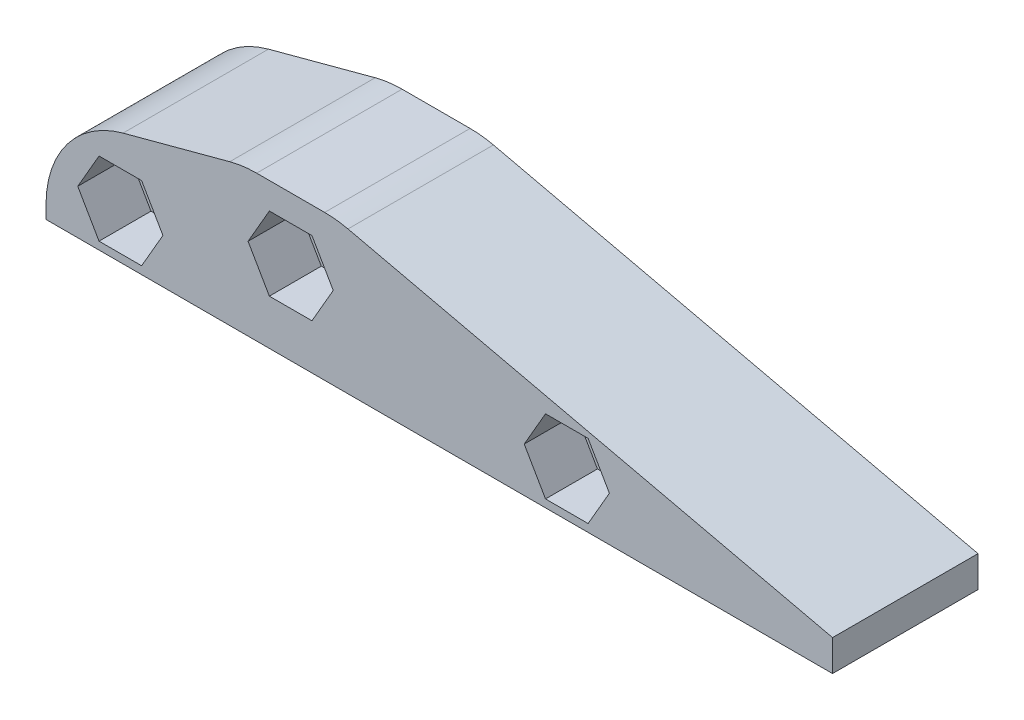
ISO-10303-21;
HEADER;
FILE_DESCRIPTION(('STEP AP214'),'2;1');
FILE_NAME('part.step','',(''),(''),'','','');
FILE_SCHEMA(('AUTOMOTIVE_DESIGN { 1 0 10303 214 1 1 1 1 }'));
ENDSEC;
DATA;
#1=APPLICATION_CONTEXT('core data for automotive mechanical design processes');
#2=APPLICATION_PROTOCOL_DEFINITION('international standard','automotive_design',2000,#1);
#3=PRODUCT_CONTEXT('',#1,'mechanical');
#4=PRODUCT('Part','Part','',(#3));
#5=PRODUCT_RELATED_PRODUCT_CATEGORY('part','',(#4));
#6=PRODUCT_DEFINITION_FORMATION('','',#4);
#7=PRODUCT_DEFINITION_CONTEXT('part definition',#1,'design');
#8=PRODUCT_DEFINITION('design','',#6,#7);
#9=PRODUCT_DEFINITION_SHAPE('','',#8);
#10=(LENGTH_UNIT() NAMED_UNIT(*) SI_UNIT(.MILLI.,.METRE.));
#11=(NAMED_UNIT(*) PLANE_ANGLE_UNIT() SI_UNIT($,.RADIAN.));
#12=(NAMED_UNIT(*) SI_UNIT($,.STERADIAN.) SOLID_ANGLE_UNIT());
#13=UNCERTAINTY_MEASURE_WITH_UNIT(LENGTH_MEASURE(1.E-05),#10,'distance_accuracy_value','');
#14=(GEOMETRIC_REPRESENTATION_CONTEXT(3) GLOBAL_UNCERTAINTY_ASSIGNED_CONTEXT((#13)) GLOBAL_UNIT_ASSIGNED_CONTEXT((#10,
#11,#12)) REPRESENTATION_CONTEXT('',''));
#15=CARTESIAN_POINT('',(0.,0.,0.));
#16=DIRECTION('',(0.,0.,1.));
#17=DIRECTION('',(1.,0.,0.));
#18=AXIS2_PLACEMENT_3D('',#15,#16,#17);
#19=CARTESIAN_POINT('',(75.7081636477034,0.,14.));
#20=DIRECTION('',(0.,1.,0.));
#21=DIRECTION('',(-1.,0.,0.));
#22=AXIS2_PLACEMENT_3D('',#19,#20,#21);
#23=PLANE('',#22);
#24=DIRECTION('',(1.,0.,0.));
#25=VECTOR('',#24,1.);
#26=CARTESIAN_POINT('',(75.7081636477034,0.,0.));
#27=LINE('',#26,#25);
#28=CARTESIAN_POINT('',(0.,0.,0.));
#29=VERTEX_POINT('',#28);
#30=CARTESIAN_POINT('',(75.7081636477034,0.,0.));
#31=VERTEX_POINT('',#30);
#32=EDGE_CURVE('E406',#29,#31,#27,.T.);
#33=ORIENTED_EDGE('',*,*,#32,.T.);
#34=DIRECTION('',(0.,0.,-1.));
#35=VECTOR('',#34,1.);
#36=CARTESIAN_POINT('',(75.7081636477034,0.,14.));
#37=LINE('',#36,#35);
#38=CARTESIAN_POINT('',(75.7081636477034,0.,14.));
#39=VERTEX_POINT('',#38);
#40=EDGE_CURVE('E471',#39,#31,#37,.T.);
#41=ORIENTED_EDGE('',*,*,#40,.F.);
#42=DIRECTION('',(1.,0.,0.));
#43=VECTOR('',#42,1.);
#44=CARTESIAN_POINT('',(75.7081636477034,0.,14.));
#45=LINE('',#44,#43);
#46=CARTESIAN_POINT('',(0.,0.,14.));
#47=VERTEX_POINT('',#46);
#48=EDGE_CURVE('E422',#47,#39,#45,.T.);
#49=ORIENTED_EDGE('',*,*,#48,.F.);
#50=DIRECTION('',(0.,0.,-1.));
#51=VECTOR('',#50,1.);
#52=CARTESIAN_POINT('',(0.,0.,14.));
#53=LINE('',#52,#51);
#54=EDGE_CURVE('E444',#47,#29,#53,.T.);
#55=ORIENTED_EDGE('',*,*,#54,.T.);
#56=EDGE_LOOP('',(#33,#41,#49,#55));
#57=FACE_BOUND('',#56,.T.);
#58=ADVANCED_FACE('F35',(#57),#23,.F.);
#59=CARTESIAN_POINT('',(75.7081636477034,3.,14.));
#60=DIRECTION('',(-1.,0.,0.));
#61=DIRECTION('',(0.,0.,1.));
#62=AXIS2_PLACEMENT_3D('',#59,#60,#61);
#63=PLANE('',#62);
#64=DIRECTION('',(0.,1.,0.));
#65=VECTOR('',#64,1.);
#66=CARTESIAN_POINT('',(75.7081636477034,3.,0.));
#67=LINE('',#66,#65);
#68=CARTESIAN_POINT('',(75.7081636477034,3.,0.));
#69=VERTEX_POINT('',#68);
#70=EDGE_CURVE('E448',#31,#69,#67,.T.);
#71=ORIENTED_EDGE('',*,*,#70,.T.);
#72=DIRECTION('',(0.,0.,-1.));
#73=VECTOR('',#72,1.);
#74=CARTESIAN_POINT('',(75.7081636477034,3.,14.));
#75=LINE('',#74,#73);
#76=CARTESIAN_POINT('',(75.7081636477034,3.,14.));
#77=VERTEX_POINT('',#76);
#78=EDGE_CURVE('E467',#77,#69,#75,.T.);
#79=ORIENTED_EDGE('',*,*,#78,.F.);
#80=DIRECTION('',(0.,1.,0.));
#81=VECTOR('',#80,1.);
#82=CARTESIAN_POINT('',(75.7081636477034,3.,14.));
#83=LINE('',#82,#81);
#84=EDGE_CURVE('E426',#39,#77,#83,.T.);
#85=ORIENTED_EDGE('',*,*,#84,.F.);
#86=ORIENTED_EDGE('',*,*,#40,.T.);
#87=EDGE_LOOP('',(#71,#79,#85,#86));
#88=FACE_BOUND('',#87,.T.);
#89=ADVANCED_FACE('F530',(#88),#63,.F.);
#90=CARTESIAN_POINT('',(27.9588181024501,14.,14.));
#91=DIRECTION('',(-0.224489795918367,-0.974476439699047,0.));
#92=DIRECTION('',(0.974476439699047,-0.224489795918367,0.));
#93=AXIS2_PLACEMENT_3D('',#90,#91,#92);
#94=PLANE('',#93);
#95=DIRECTION('',(-0.974476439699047,0.224489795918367,0.));
#96=VECTOR('',#95,1.);
#97=CARTESIAN_POINT('',(27.9588181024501,14.,0.));
#98=LINE('',#97,#96);
#99=CARTESIAN_POINT('',(29.0667574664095,13.7447643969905,0.));
#100=VERTEX_POINT('',#99);
#101=EDGE_CURVE('E451',#69,#100,#98,.T.);
#102=ORIENTED_EDGE('',*,*,#101,.T.);
#103=DIRECTION('',(0.,0.,-1.));
#104=VECTOR('',#103,1.);
#105=CARTESIAN_POINT('',(29.0667574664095,13.7447643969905,14.));
#106=LINE('',#105,#104);
#107=CARTESIAN_POINT('',(29.0667574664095,13.7447643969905,14.));
#108=VERTEX_POINT('',#107);
#109=EDGE_CURVE('E503',#100,#108,#106,.F.);
#110=ORIENTED_EDGE('',*,*,#109,.T.);
#111=DIRECTION('',(-0.974476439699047,0.224489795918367,0.));
#112=VECTOR('',#111,1.);
#113=CARTESIAN_POINT('',(27.9588181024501,14.,14.));
#114=LINE('',#113,#112);
#115=EDGE_CURVE('E430',#77,#108,#114,.T.);
#116=ORIENTED_EDGE('',*,*,#115,.F.);
#117=ORIENTED_EDGE('',*,*,#78,.T.);
#118=EDGE_LOOP('',(#102,#110,#116,#117));
#119=FACE_BOUND('',#118,.T.);
#120=ADVANCED_FACE('F527',(#119),#94,.F.);
#121=CARTESIAN_POINT('',(18.9588181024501,14.,14.));
#122=DIRECTION('',(0.,-1.,0.));
#123=DIRECTION('',(0.,0.,-1.));
#124=AXIS2_PLACEMENT_3D('',#121,#122,#123);
#125=PLANE('',#124);
#126=DIRECTION('',(-1.,0.,0.));
#127=VECTOR('',#126,1.);
#128=CARTESIAN_POINT('',(18.9588181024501,14.,14.));
#129=LINE('',#128,#127);
#130=CARTESIAN_POINT('',(26.8218595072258,14.,14.));
#131=VERTEX_POINT('',#130);
#132=CARTESIAN_POINT('',(20.275343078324,14.,14.));
#133=VERTEX_POINT('',#132);
#134=EDGE_CURVE('E434',#131,#133,#129,.T.);
#135=ORIENTED_EDGE('',*,*,#134,.F.);
#136=DIRECTION('',(0.,0.,-1.));
#137=VECTOR('',#136,1.);
#138=CARTESIAN_POINT('',(26.8218595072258,14.,14.));
#139=LINE('',#138,#137);
#140=CARTESIAN_POINT('',(26.8218595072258,14.,0.));
#141=VERTEX_POINT('',#140);
#142=EDGE_CURVE('E493',#131,#141,#139,.T.);
#143=ORIENTED_EDGE('',*,*,#142,.T.);
#144=DIRECTION('',(-1.,0.,0.));
#145=VECTOR('',#144,1.);
#146=CARTESIAN_POINT('',(18.9588181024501,14.,0.));
#147=LINE('',#146,#145);
#148=CARTESIAN_POINT('',(20.275343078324,14.,0.));
#149=VERTEX_POINT('',#148);
#150=EDGE_CURVE('E455',#141,#149,#147,.T.);
#151=ORIENTED_EDGE('',*,*,#150,.T.);
#152=DIRECTION('',(0.,0.,-1.));
#153=VECTOR('',#152,1.);
#154=CARTESIAN_POINT('',(20.275343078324,14.,14.));
#155=LINE('',#154,#153);
#156=EDGE_CURVE('E490',#149,#133,#155,.F.);
#157=ORIENTED_EDGE('',*,*,#156,.T.);
#158=EDGE_LOOP('',(#135,#143,#151,#157));
#159=FACE_BOUND('',#158,.T.);
#160=ADVANCED_FACE('F519',(#159),#125,.F.);
#161=CARTESIAN_POINT('',(0.,8.92,14.));
#162=DIRECTION('',(0.258819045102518,-0.965925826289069,0.));
#163=DIRECTION('',(0.965925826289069,0.258819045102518,0.));
#164=AXIS2_PLACEMENT_3D('',#161,#162,#163);
#165=PLANE('',#164);
#166=DIRECTION('',(-0.965925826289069,-0.258819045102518,0.));
#167=VECTOR('',#166,1.);
#168=CARTESIAN_POINT('',(0.,8.92,14.));
#169=LINE('',#168,#167);
#170=CARTESIAN_POINT('',(17.6871526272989,13.6592582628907,14.));
#171=VERTEX_POINT('',#170);
#172=CARTESIAN_POINT('',(7.41180954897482,10.9059883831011,14.));
#173=VERTEX_POINT('',#172);
#174=EDGE_CURVE('E438',#171,#173,#169,.T.);
#175=ORIENTED_EDGE('',*,*,#174,.F.);
#176=DIRECTION('',(0.,0.,-1.));
#177=VECTOR('',#176,1.);
#178=CARTESIAN_POINT('',(17.6871526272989,13.6592582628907,14.));
#179=LINE('',#178,#177);
#180=CARTESIAN_POINT('',(17.6871526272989,13.6592582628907,0.));
#181=VERTEX_POINT('',#180);
#182=EDGE_CURVE('E11',#171,#181,#179,.T.);
#183=ORIENTED_EDGE('',*,*,#182,.T.);
#184=DIRECTION('',(-0.965925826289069,-0.258819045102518,0.));
#185=VECTOR('',#184,1.);
#186=CARTESIAN_POINT('',(0.,8.92,0.));
#187=LINE('',#186,#185);
#188=CARTESIAN_POINT('',(7.41180954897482,10.9059883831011,0.));
#189=VERTEX_POINT('',#188);
#190=EDGE_CURVE('E459',#181,#189,#187,.T.);
#191=ORIENTED_EDGE('',*,*,#190,.T.);
#192=DIRECTION('',(0.,0.,-1.));
#193=VECTOR('',#192,1.);
#194=CARTESIAN_POINT('',(7.41180954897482,10.9059883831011,14.));
#195=LINE('',#194,#193);
#196=EDGE_CURVE('E483',#189,#173,#195,.F.);
#197=ORIENTED_EDGE('',*,*,#196,.T.);
#198=EDGE_LOOP('',(#175,#183,#191,#197));
#199=FACE_BOUND('',#198,.T.);
#200=ADVANCED_FACE('F548',(#199),#165,.F.);
#201=CARTESIAN_POINT('',(0.,0.,14.));
#202=DIRECTION('',(1.,0.,0.));
#203=DIRECTION('',(0.,0.,-1.));
#204=AXIS2_PLACEMENT_3D('',#201,#202,#203);
#205=PLANE('',#204);
#206=DIRECTION('',(0.,-1.,0.));
#207=VECTOR('',#206,1.);
#208=CARTESIAN_POINT('',(0.,0.,14.));
#209=LINE('',#208,#207);
#210=CARTESIAN_POINT('',(0.,1.24673012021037,14.));
#211=VERTEX_POINT('',#210);
#212=EDGE_CURVE('E441',#211,#47,#209,.T.);
#213=ORIENTED_EDGE('',*,*,#212,.F.);
#214=DIRECTION('',(0.,0.,-1.));
#215=VECTOR('',#214,1.);
#216=CARTESIAN_POINT('',(0.,1.24673012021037,14.));
#217=LINE('',#216,#215);
#218=CARTESIAN_POINT('',(0.,1.24673012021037,0.));
#219=VERTEX_POINT('',#218);
#220=EDGE_CURVE('E475',#211,#219,#217,.T.);
#221=ORIENTED_EDGE('',*,*,#220,.T.);
#222=DIRECTION('',(0.,-1.,0.));
#223=VECTOR('',#222,1.);
#224=CARTESIAN_POINT('',(0.,0.,0.));
#225=LINE('',#224,#223);
#226=EDGE_CURVE('E427',#219,#29,#225,.T.);
#227=ORIENTED_EDGE('',*,*,#226,.T.);
#228=ORIENTED_EDGE('',*,*,#54,.F.);
#229=EDGE_LOOP('',(#213,#221,#227,#228));
#230=FACE_BOUND('',#229,.T.);
#231=ADVANCED_FACE('F539',(#230),#205,.F.);
#232=CARTESIAN_POINT('',(0.,0.,14.));
#233=DIRECTION('',(0.,0.,-1.));
#234=DIRECTION('',(-1.,0.,0.));
#235=AXIS2_PLACEMENT_3D('',#232,#233,#234);
#236=PLANE('',#235);
#237=DIRECTION('',(0.5,0.866025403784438,0.));
#238=VECTOR('',#237,1.);
#239=CARTESIAN_POINT('',(25.5981947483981,4.35688835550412,14.));
#240=LINE('',#239,#238);
#241=CARTESIAN_POINT('',(25.5981947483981,4.35688835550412,14.));
#242=VERTEX_POINT('',#241);
#243=CARTESIAN_POINT('',(27.6477882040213,7.90688835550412,14.));
#244=VERTEX_POINT('',#243);
#245=EDGE_CURVE('E262',#242,#244,#240,.T.);
#246=ORIENTED_EDGE('',*,*,#245,.F.);
#247=DIRECTION('',(1.,0.,0.));
#248=VECTOR('',#247,1.);
#249=CARTESIAN_POINT('',(21.4990078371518,4.35688835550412,14.));
#250=LINE('',#249,#248);
#251=CARTESIAN_POINT('',(21.4990078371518,4.35688835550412,14.));
#252=VERTEX_POINT('',#251);
#253=EDGE_CURVE('E51',#252,#242,#250,.T.);
#254=ORIENTED_EDGE('',*,*,#253,.F.);
#255=DIRECTION('',(0.499999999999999,-0.866025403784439,0.));
#256=VECTOR('',#255,1.);
#257=CARTESIAN_POINT('',(19.4494143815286,7.90688835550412,14.));
#258=LINE('',#257,#256);
#259=CARTESIAN_POINT('',(19.4494143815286,7.90688835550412,14.));
#260=VERTEX_POINT('',#259);
#261=EDGE_CURVE('E239',#260,#252,#258,.T.);
#262=ORIENTED_EDGE('',*,*,#261,.F.);
#263=DIRECTION('',(-0.5,-0.866025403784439,0.));
#264=VECTOR('',#263,1.);
#265=CARTESIAN_POINT('',(21.4990078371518,11.4568883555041,14.));
#266=LINE('',#265,#264);
#267=CARTESIAN_POINT('',(21.4990078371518,11.4568883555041,14.));
#268=VERTEX_POINT('',#267);
#269=EDGE_CURVE('E243',#268,#260,#266,.T.);
#270=ORIENTED_EDGE('',*,*,#269,.F.);
#271=DIRECTION('',(-1.,0.,0.));
#272=VECTOR('',#271,1.);
#273=CARTESIAN_POINT('',(25.5981947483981,11.4568883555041,14.));
#274=LINE('',#273,#272);
#275=CARTESIAN_POINT('',(25.5981947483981,11.4568883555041,14.));
#276=VERTEX_POINT('',#275);
#277=EDGE_CURVE('E270',#276,#268,#274,.T.);
#278=ORIENTED_EDGE('',*,*,#277,.F.);
#279=DIRECTION('',(-0.5,0.866025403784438,0.));
#280=VECTOR('',#279,1.);
#281=CARTESIAN_POINT('',(27.6477882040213,7.90688835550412,14.));
#282=LINE('',#281,#280);
#283=EDGE_CURVE('E266',#244,#276,#282,.T.);
#284=ORIENTED_EDGE('',*,*,#283,.F.);
#285=EDGE_LOOP('',(#246,#254,#262,#270,#278,#284));
#286=FACE_BOUND('',#285,.T.);
#287=DIRECTION('',(0.5,0.866025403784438,0.));
#288=VECTOR('',#287,1.);
#289=CARTESIAN_POINT('',(52.1792396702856,0.743591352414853,14.));
#290=LINE('',#289,#288);
#291=CARTESIAN_POINT('',(52.1792396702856,0.743591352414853,14.));
#292=VERTEX_POINT('',#291);
#293=CARTESIAN_POINT('',(54.2288331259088,4.29359135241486,14.));
#294=VERTEX_POINT('',#293);
#295=EDGE_CURVE('E320',#292,#294,#290,.T.);
#296=ORIENTED_EDGE('',*,*,#295,.F.);
#297=DIRECTION('',(1.,0.,0.));
#298=VECTOR('',#297,1.);
#299=CARTESIAN_POINT('',(48.0800527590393,0.743591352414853,14.));
#300=LINE('',#299,#298);
#301=CARTESIAN_POINT('',(48.0800527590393,0.743591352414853,14.));
#302=VERTEX_POINT('',#301);
#303=EDGE_CURVE('E59',#302,#292,#300,.T.);
#304=ORIENTED_EDGE('',*,*,#303,.F.);
#305=DIRECTION('',(0.5,-0.866025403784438,0.));
#306=VECTOR('',#305,1.);
#307=CARTESIAN_POINT('',(46.0304593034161,4.29359135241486,14.));
#308=LINE('',#307,#306);
#309=CARTESIAN_POINT('',(46.0304593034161,4.29359135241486,14.));
#310=VERTEX_POINT('',#309);
#311=EDGE_CURVE('E297',#310,#302,#308,.T.);
#312=ORIENTED_EDGE('',*,*,#311,.F.);
#313=DIRECTION('',(-0.5,-0.866025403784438,0.));
#314=VECTOR('',#313,1.);
#315=CARTESIAN_POINT('',(48.0800527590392,7.84359135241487,14.));
#316=LINE('',#315,#314);
#317=CARTESIAN_POINT('',(48.0800527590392,7.84359135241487,14.));
#318=VERTEX_POINT('',#317);
#319=EDGE_CURVE('E333',#318,#310,#316,.T.);
#320=ORIENTED_EDGE('',*,*,#319,.F.);
#321=DIRECTION('',(-1.,0.,0.));
#322=VECTOR('',#321,1.);
#323=CARTESIAN_POINT('',(52.1792396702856,7.84359135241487,14.));
#324=LINE('',#323,#322);
#325=CARTESIAN_POINT('',(52.1792396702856,7.84359135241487,14.));
#326=VERTEX_POINT('',#325);
#327=EDGE_CURVE('E329',#326,#318,#324,.T.);
#328=ORIENTED_EDGE('',*,*,#327,.F.);
#329=DIRECTION('',(-0.499999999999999,0.866025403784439,0.));
#330=VECTOR('',#329,1.);
#331=CARTESIAN_POINT('',(54.2288331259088,4.29359135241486,14.));
#332=LINE('',#331,#330);
#333=EDGE_CURVE('E325',#294,#326,#332,.T.);
#334=ORIENTED_EDGE('',*,*,#333,.F.);
#335=EDGE_LOOP('',(#296,#304,#312,#320,#328,#334));
#336=FACE_BOUND('',#335,.T.);
#337=DIRECTION('',(0.5,0.866025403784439,0.));
#338=VECTOR('',#337,1.);
#339=CARTESIAN_POINT('',(9.2045979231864,0.743591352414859,14.));
#340=LINE('',#339,#338);
#341=CARTESIAN_POINT('',(9.2045979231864,0.743591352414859,14.));
#342=VERTEX_POINT('',#341);
#343=CARTESIAN_POINT('',(11.2541913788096,4.29359135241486,14.));
#344=VERTEX_POINT('',#343);
#345=EDGE_CURVE('E384',#342,#344,#340,.T.);
#346=ORIENTED_EDGE('',*,*,#345,.F.);
#347=DIRECTION('',(1.,0.,0.));
#348=VECTOR('',#347,1.);
#349=CARTESIAN_POINT('',(5.10541101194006,0.743591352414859,14.));
#350=LINE('',#349,#348);
#351=CARTESIAN_POINT('',(5.10541101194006,0.743591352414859,14.));
#352=VERTEX_POINT('',#351);
#353=EDGE_CURVE('E280',#352,#342,#350,.T.);
#354=ORIENTED_EDGE('',*,*,#353,.F.);
#355=DIRECTION('',(0.5,-0.866025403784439,0.));
#356=VECTOR('',#355,1.);
#357=CARTESIAN_POINT('',(3.05581755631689,4.29359135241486,14.));
#358=LINE('',#357,#356);
#359=CARTESIAN_POINT('',(3.05581755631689,4.29359135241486,14.));
#360=VERTEX_POINT('',#359);
#361=EDGE_CURVE('E361',#360,#352,#358,.T.);
#362=ORIENTED_EDGE('',*,*,#361,.F.);
#363=DIRECTION('',(-0.5,-0.866025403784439,0.));
#364=VECTOR('',#363,1.);
#365=CARTESIAN_POINT('',(5.10541101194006,7.84359135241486,14.));
#366=LINE('',#365,#364);
#367=CARTESIAN_POINT('',(5.10541101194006,7.84359135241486,14.));
#368=VERTEX_POINT('',#367);
#369=EDGE_CURVE('E396',#368,#360,#366,.T.);
#370=ORIENTED_EDGE('',*,*,#369,.F.);
#371=DIRECTION('',(-1.,0.,0.));
#372=VECTOR('',#371,1.);
#373=CARTESIAN_POINT('',(9.2045979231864,7.84359135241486,14.));
#374=LINE('',#373,#372);
#375=CARTESIAN_POINT('',(9.2045979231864,7.84359135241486,14.));
#376=VERTEX_POINT('',#375);
#377=EDGE_CURVE('E392',#376,#368,#374,.T.);
#378=ORIENTED_EDGE('',*,*,#377,.F.);
#379=DIRECTION('',(-0.5,0.866025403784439,0.));
#380=VECTOR('',#379,1.);
#381=CARTESIAN_POINT('',(11.2541913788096,4.29359135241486,14.));
#382=LINE('',#381,#380);
#383=EDGE_CURVE('E388',#344,#376,#382,.T.);
#384=ORIENTED_EDGE('',*,*,#383,.F.);
#385=EDGE_LOOP('',(#346,#354,#362,#370,#378,#384));
#386=FACE_BOUND('',#385,.T.);
#387=ORIENTED_EDGE('',*,*,#115,.T.);
#388=CARTESIAN_POINT('',(26.8218595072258,3.99999999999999,14.));
#389=DIRECTION('',(0.,0.,-1.));
#390=DIRECTION('',(-1.,0.,0.));
#391=AXIS2_PLACEMENT_3D('',#388,#389,#390);
#392=CIRCLE('',#391,10.);
#393=EDGE_CURVE('E44',#108,#131,#392,.F.);
#394=ORIENTED_EDGE('',*,*,#393,.T.);
#395=ORIENTED_EDGE('',*,*,#134,.T.);
#396=CARTESIAN_POINT('',(20.275343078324,3.99999999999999,14.));
#397=DIRECTION('',(0.,0.,-1.));
#398=DIRECTION('',(-1.,0.,0.));
#399=AXIS2_PLACEMENT_3D('',#396,#397,#398);
#400=CIRCLE('',#399,10.);
#401=EDGE_CURVE('E506',#133,#171,#400,.F.);
#402=ORIENTED_EDGE('',*,*,#401,.T.);
#403=ORIENTED_EDGE('',*,*,#174,.T.);
#404=CARTESIAN_POINT('',(10.,1.24673012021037,14.));
#405=DIRECTION('',(0.,0.,-1.));
#406=DIRECTION('',(-1.,0.,0.));
#407=AXIS2_PLACEMENT_3D('',#404,#405,#406);
#408=CIRCLE('',#407,10.);
#409=EDGE_CURVE('E487',#173,#211,#408,.F.);
#410=ORIENTED_EDGE('',*,*,#409,.T.);
#411=ORIENTED_EDGE('',*,*,#212,.T.);
#412=ORIENTED_EDGE('',*,*,#48,.T.);
#413=ORIENTED_EDGE('',*,*,#84,.T.);
#414=EDGE_LOOP('',(#387,#394,#395,#402,#403,#410,#411,#412,#413));
#415=FACE_BOUND('',#414,.T.);
#416=ADVANCED_FACE('F512',(#286,#336,#386,#415),#236,.F.);
#417=CARTESIAN_POINT('',(0.,0.,0.));
#418=DIRECTION('',(0.,0.,-1.));
#419=DIRECTION('',(-1.,0.,0.));
#420=AXIS2_PLACEMENT_3D('',#417,#418,#419);
#421=PLANE('',#420);
#422=CARTESIAN_POINT('',(23.5486012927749,7.90688835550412,0.));
#423=DIRECTION('',(0.,0.,1.));
#424=DIRECTION('',(1.,0.,0.));
#425=AXIS2_PLACEMENT_3D('',#422,#423,#424);
#426=CIRCLE('',#425,2.05);
#427=CARTESIAN_POINT('',(25.5986012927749,7.90688835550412,0.));
#428=VERTEX_POINT('',#427);
#429=EDGE_CURVE('E868',#428,#428,#426,.T.);
#430=ORIENTED_EDGE('',*,*,#429,.T.);
#431=EDGE_LOOP('',(#430));
#432=FACE_BOUND('',#431,.T.);
#433=CARTESIAN_POINT('',(50.1296462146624,4.29359135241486,0.));
#434=DIRECTION('',(0.,0.,1.));
#435=DIRECTION('',(1.,0.,0.));
#436=AXIS2_PLACEMENT_3D('',#433,#434,#435);
#437=CIRCLE('',#436,2.04999999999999);
#438=CARTESIAN_POINT('',(52.1796462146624,4.29359135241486,0.));
#439=VERTEX_POINT('',#438);
#440=EDGE_CURVE('E852',#439,#439,#437,.T.);
#441=ORIENTED_EDGE('',*,*,#440,.T.);
#442=EDGE_LOOP('',(#441));
#443=FACE_BOUND('',#442,.T.);
#444=CARTESIAN_POINT('',(7.15500446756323,4.29359135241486,0.));
#445=DIRECTION('',(0.,0.,1.));
#446=DIRECTION('',(1.,0.,0.));
#447=AXIS2_PLACEMENT_3D('',#444,#445,#446);
#448=CIRCLE('',#447,2.05);
#449=CARTESIAN_POINT('',(9.20500446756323,4.29359135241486,0.));
#450=VERTEX_POINT('',#449);
#451=EDGE_CURVE('E321',#450,#450,#448,.T.);
#452=ORIENTED_EDGE('',*,*,#451,.T.);
#453=EDGE_LOOP('',(#452));
#454=FACE_BOUND('',#453,.T.);
#455=ORIENTED_EDGE('',*,*,#150,.F.);
#456=CARTESIAN_POINT('',(26.8218595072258,3.99999999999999,0.));
#457=DIRECTION('',(0.,0.,-1.));
#458=DIRECTION('',(-1.,0.,0.));
#459=AXIS2_PLACEMENT_3D('',#456,#457,#458);
#460=CIRCLE('',#459,10.);
#461=EDGE_CURVE('E500',#141,#100,#460,.T.);
#462=ORIENTED_EDGE('',*,*,#461,.T.);
#463=ORIENTED_EDGE('',*,*,#101,.F.);
#464=ORIENTED_EDGE('',*,*,#70,.F.);
#465=ORIENTED_EDGE('',*,*,#32,.F.);
#466=ORIENTED_EDGE('',*,*,#226,.F.);
#467=CARTESIAN_POINT('',(10.,1.24673012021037,0.));
#468=DIRECTION('',(0.,0.,-1.));
#469=DIRECTION('',(-1.,0.,0.));
#470=AXIS2_PLACEMENT_3D('',#467,#468,#469);
#471=CIRCLE('',#470,10.);
#472=EDGE_CURVE('E479',#219,#189,#471,.T.);
#473=ORIENTED_EDGE('',*,*,#472,.T.);
#474=ORIENTED_EDGE('',*,*,#190,.F.);
#475=CARTESIAN_POINT('',(20.275343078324,3.99999999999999,0.));
#476=DIRECTION('',(0.,0.,-1.));
#477=DIRECTION('',(-1.,0.,0.));
#478=AXIS2_PLACEMENT_3D('',#475,#476,#477);
#479=CIRCLE('',#478,10.);
#480=EDGE_CURVE('E497',#181,#149,#479,.T.);
#481=ORIENTED_EDGE('',*,*,#480,.T.);
#482=EDGE_LOOP('',(#455,#462,#463,#464,#465,#466,#473,#474,#481));
#483=FACE_BOUND('',#482,.T.);
#484=ADVANCED_FACE('F525',(#432,#443,#454,#483),#421,.T.);
#485=CARTESIAN_POINT('',(10.,1.24673012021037,14.));
#486=DIRECTION('',(0.,0.,-1.));
#487=DIRECTION('',(-1.,0.,0.));
#488=AXIS2_PLACEMENT_3D('',#485,#486,#487);
#489=CYLINDRICAL_SURFACE('',#488,10.);
#490=ORIENTED_EDGE('',*,*,#409,.F.);
#491=ORIENTED_EDGE('',*,*,#196,.F.);
#492=ORIENTED_EDGE('',*,*,#472,.F.);
#493=ORIENTED_EDGE('',*,*,#220,.F.);
#494=EDGE_LOOP('',(#490,#491,#492,#493));
#495=FACE_BOUND('',#494,.T.);
#496=ADVANCED_FACE('F543',(#495),#489,.T.);
#497=CARTESIAN_POINT('',(26.8218595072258,3.99999999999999,14.));
#498=DIRECTION('',(0.,0.,-1.));
#499=DIRECTION('',(-1.,0.,0.));
#500=AXIS2_PLACEMENT_3D('',#497,#498,#499);
#501=CYLINDRICAL_SURFACE('',#500,10.);
#502=ORIENTED_EDGE('',*,*,#393,.F.);
#503=ORIENTED_EDGE('',*,*,#109,.F.);
#504=ORIENTED_EDGE('',*,*,#461,.F.);
#505=ORIENTED_EDGE('',*,*,#142,.F.);
#506=EDGE_LOOP('',(#502,#503,#504,#505));
#507=FACE_BOUND('',#506,.T.);
#508=ADVANCED_FACE('F522',(#507),#501,.T.);
#509=CARTESIAN_POINT('',(20.275343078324,3.99999999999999,14.));
#510=DIRECTION('',(0.,0.,-1.));
#511=DIRECTION('',(-1.,0.,0.));
#512=AXIS2_PLACEMENT_3D('',#509,#510,#511);
#513=CYLINDRICAL_SURFACE('',#512,10.);
#514=ORIENTED_EDGE('',*,*,#401,.F.);
#515=ORIENTED_EDGE('',*,*,#156,.F.);
#516=ORIENTED_EDGE('',*,*,#480,.F.);
#517=ORIENTED_EDGE('',*,*,#182,.F.);
#518=EDGE_LOOP('',(#514,#515,#516,#517));
#519=FACE_BOUND('',#518,.T.);
#520=ADVANCED_FACE('F37',(#519),#513,.T.);
#521=CARTESIAN_POINT('',(5.10541101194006,0.743591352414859,9.));
#522=DIRECTION('',(0.,-1.,0.));
#523=DIRECTION('',(0.,0.,-1.));
#524=AXIS2_PLACEMENT_3D('',#521,#522,#523);
#525=PLANE('',#524);
#526=ORIENTED_EDGE('',*,*,#353,.T.);
#527=DIRECTION('',(0.,0.,1.));
#528=VECTOR('',#527,1.);
#529=CARTESIAN_POINT('',(9.2045979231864,0.743591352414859,9.));
#530=LINE('',#529,#528);
#531=CARTESIAN_POINT('',(9.2045979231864,0.743591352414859,9.));
#532=VERTEX_POINT('',#531);
#533=EDGE_CURVE('E381',#532,#342,#530,.T.);
#534=ORIENTED_EDGE('',*,*,#533,.F.);
#535=DIRECTION('',(1.,0.,0.));
#536=VECTOR('',#535,1.);
#537=CARTESIAN_POINT('',(5.10541101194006,0.743591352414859,9.));
#538=LINE('',#537,#536);
#539=CARTESIAN_POINT('',(5.10541101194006,0.743591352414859,9.));
#540=VERTEX_POINT('',#539);
#541=EDGE_CURVE('E356',#540,#532,#538,.T.);
#542=ORIENTED_EDGE('',*,*,#541,.F.);
#543=DIRECTION('',(0.,0.,1.));
#544=VECTOR('',#543,1.);
#545=CARTESIAN_POINT('',(5.10541101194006,0.743591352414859,9.));
#546=LINE('',#545,#544);
#547=EDGE_CURVE('E403',#540,#352,#546,.T.);
#548=ORIENTED_EDGE('',*,*,#547,.T.);
#549=EDGE_LOOP('',(#526,#534,#542,#548));
#550=FACE_BOUND('',#549,.T.);
#551=ADVANCED_FACE('F552',(#550),#525,.F.);
#552=CARTESIAN_POINT('',(3.05581755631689,4.29359135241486,9.));
#553=DIRECTION('',(-0.866025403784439,-0.5,0.));
#554=DIRECTION('',(0.5,-0.866025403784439,0.));
#555=AXIS2_PLACEMENT_3D('',#552,#553,#554);
#556=PLANE('',#555);
#557=ORIENTED_EDGE('',*,*,#361,.T.);
#558=ORIENTED_EDGE('',*,*,#547,.F.);
#559=DIRECTION('',(0.5,-0.866025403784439,0.));
#560=VECTOR('',#559,1.);
#561=CARTESIAN_POINT('',(3.05581755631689,4.29359135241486,9.));
#562=LINE('',#561,#560);
#563=CARTESIAN_POINT('',(3.05581755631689,4.29359135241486,9.));
#564=VERTEX_POINT('',#563);
#565=EDGE_CURVE('E377',#564,#540,#562,.T.);
#566=ORIENTED_EDGE('',*,*,#565,.F.);
#567=DIRECTION('',(0.,0.,1.));
#568=VECTOR('',#567,1.);
#569=CARTESIAN_POINT('',(3.05581755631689,4.29359135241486,9.));
#570=LINE('',#569,#568);
#571=EDGE_CURVE('E407',#564,#360,#570,.T.);
#572=ORIENTED_EDGE('',*,*,#571,.T.);
#573=EDGE_LOOP('',(#557,#558,#566,#572));
#574=FACE_BOUND('',#573,.T.);
#575=ADVANCED_FACE('F557',(#574),#556,.F.);
#576=CARTESIAN_POINT('',(5.10541101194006,7.84359135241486,9.));
#577=DIRECTION('',(-0.866025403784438,0.5,0.));
#578=DIRECTION('',(-0.5,-0.866025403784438,0.));
#579=AXIS2_PLACEMENT_3D('',#576,#577,#578);
#580=PLANE('',#579);
#581=ORIENTED_EDGE('',*,*,#369,.T.);
#582=ORIENTED_EDGE('',*,*,#571,.F.);
#583=DIRECTION('',(-0.5,-0.866025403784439,0.));
#584=VECTOR('',#583,1.);
#585=CARTESIAN_POINT('',(5.10541101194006,7.84359135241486,9.));
#586=LINE('',#585,#584);
#587=CARTESIAN_POINT('',(5.10541101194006,7.84359135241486,9.));
#588=VERTEX_POINT('',#587);
#589=EDGE_CURVE('E373',#588,#564,#586,.T.);
#590=ORIENTED_EDGE('',*,*,#589,.F.);
#591=DIRECTION('',(0.,0.,1.));
#592=VECTOR('',#591,1.);
#593=CARTESIAN_POINT('',(5.10541101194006,7.84359135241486,9.));
#594=LINE('',#593,#592);
#595=EDGE_CURVE('E410',#588,#368,#594,.T.);
#596=ORIENTED_EDGE('',*,*,#595,.T.);
#597=EDGE_LOOP('',(#581,#582,#590,#596));
#598=FACE_BOUND('',#597,.T.);
#599=ADVANCED_FACE('F627',(#598),#580,.F.);
#600=CARTESIAN_POINT('',(9.2045979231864,7.84359135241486,9.));
#601=DIRECTION('',(0.,1.,0.));
#602=DIRECTION('',(0.,0.,1.));
#603=AXIS2_PLACEMENT_3D('',#600,#601,#602);
#604=PLANE('',#603);
#605=ORIENTED_EDGE('',*,*,#377,.T.);
#606=ORIENTED_EDGE('',*,*,#595,.F.);
#607=DIRECTION('',(-1.,0.,0.));
#608=VECTOR('',#607,1.);
#609=CARTESIAN_POINT('',(9.2045979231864,7.84359135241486,9.));
#610=LINE('',#609,#608);
#611=CARTESIAN_POINT('',(9.2045979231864,7.84359135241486,9.));
#612=VERTEX_POINT('',#611);
#613=EDGE_CURVE('E369',#612,#588,#610,.T.);
#614=ORIENTED_EDGE('',*,*,#613,.F.);
#615=DIRECTION('',(0.,0.,1.));
#616=VECTOR('',#615,1.);
#617=CARTESIAN_POINT('',(9.2045979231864,7.84359135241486,9.));
#618=LINE('',#617,#616);
#619=EDGE_CURVE('E413',#612,#376,#618,.T.);
#620=ORIENTED_EDGE('',*,*,#619,.T.);
#621=EDGE_LOOP('',(#605,#606,#614,#620));
#622=FACE_BOUND('',#621,.T.);
#623=ADVANCED_FACE('F637',(#622),#604,.F.);
#624=CARTESIAN_POINT('',(11.2541913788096,4.29359135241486,9.));
#625=DIRECTION('',(0.866025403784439,0.5,0.));
#626=DIRECTION('',(-0.5,0.866025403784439,0.));
#627=AXIS2_PLACEMENT_3D('',#624,#625,#626);
#628=PLANE('',#627);
#629=ORIENTED_EDGE('',*,*,#383,.T.);
#630=ORIENTED_EDGE('',*,*,#619,.F.);
#631=DIRECTION('',(-0.5,0.866025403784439,0.));
#632=VECTOR('',#631,1.);
#633=CARTESIAN_POINT('',(11.2541913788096,4.29359135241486,9.));
#634=LINE('',#633,#632);
#635=CARTESIAN_POINT('',(11.2541913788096,4.29359135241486,9.));
#636=VERTEX_POINT('',#635);
#637=EDGE_CURVE('E365',#636,#612,#634,.T.);
#638=ORIENTED_EDGE('',*,*,#637,.F.);
#639=DIRECTION('',(0.,0.,1.));
#640=VECTOR('',#639,1.);
#641=CARTESIAN_POINT('',(11.2541913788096,4.29359135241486,9.));
#642=LINE('',#641,#640);
#643=EDGE_CURVE('E416',#636,#344,#642,.T.);
#644=ORIENTED_EDGE('',*,*,#643,.T.);
#645=EDGE_LOOP('',(#629,#630,#638,#644));
#646=FACE_BOUND('',#645,.T.);
#647=ADVANCED_FACE('F647',(#646),#628,.F.);
#648=CARTESIAN_POINT('',(9.2045979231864,0.743591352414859,9.));
#649=DIRECTION('',(0.866025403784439,-0.5,0.));
#650=DIRECTION('',(0.5,0.866025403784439,0.));
#651=AXIS2_PLACEMENT_3D('',#648,#649,#650);
#652=PLANE('',#651);
#653=ORIENTED_EDGE('',*,*,#345,.T.);
#654=ORIENTED_EDGE('',*,*,#643,.F.);
#655=DIRECTION('',(0.5,0.866025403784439,0.));
#656=VECTOR('',#655,1.);
#657=CARTESIAN_POINT('',(9.2045979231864,0.743591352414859,9.));
#658=LINE('',#657,#656);
#659=EDGE_CURVE('E360',#532,#636,#658,.T.);
#660=ORIENTED_EDGE('',*,*,#659,.F.);
#661=ORIENTED_EDGE('',*,*,#533,.T.);
#662=EDGE_LOOP('',(#653,#654,#660,#661));
#663=FACE_BOUND('',#662,.T.);
#664=ADVANCED_FACE('F657',(#663),#652,.F.);
#665=CARTESIAN_POINT('',(0.,0.,9.));
#666=DIRECTION('',(0.,0.,1.));
#667=DIRECTION('',(1.,0.,0.));
#668=AXIS2_PLACEMENT_3D('',#665,#666,#667);
#669=PLANE('',#668);
#670=CARTESIAN_POINT('',(7.15500446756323,4.29359135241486,9.));
#671=DIRECTION('',(0.,0.,1.));
#672=DIRECTION('',(1.,0.,0.));
#673=AXIS2_PLACEMENT_3D('',#670,#671,#672);
#674=CIRCLE('',#673,2.05);
#675=CARTESIAN_POINT('',(9.20500446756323,4.29359135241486,9.));
#676=VERTEX_POINT('',#675);
#677=EDGE_CURVE('E246',#676,#676,#674,.T.);
#678=ORIENTED_EDGE('',*,*,#677,.F.);
#679=EDGE_LOOP('',(#678));
#680=FACE_BOUND('',#679,.T.);
#681=ORIENTED_EDGE('',*,*,#541,.T.);
#682=ORIENTED_EDGE('',*,*,#659,.T.);
#683=ORIENTED_EDGE('',*,*,#637,.T.);
#684=ORIENTED_EDGE('',*,*,#613,.T.);
#685=ORIENTED_EDGE('',*,*,#589,.T.);
#686=ORIENTED_EDGE('',*,*,#565,.T.);
#687=EDGE_LOOP('',(#681,#682,#683,#684,#685,#686));
#688=FACE_BOUND('',#687,.T.);
#689=ADVANCED_FACE('F667',(#680,#688),#669,.T.);
#690=CARTESIAN_POINT('',(48.0800527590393,0.743591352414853,9.));
#691=DIRECTION('',(0.,-1.,0.));
#692=DIRECTION('',(0.,0.,-1.));
#693=AXIS2_PLACEMENT_3D('',#690,#691,#692);
#694=PLANE('',#693);
#695=ORIENTED_EDGE('',*,*,#303,.T.);
#696=DIRECTION('',(0.,0.,1.));
#697=VECTOR('',#696,1.);
#698=CARTESIAN_POINT('',(52.1792396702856,0.743591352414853,9.));
#699=LINE('',#698,#697);
#700=CARTESIAN_POINT('',(52.1792396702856,0.743591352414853,9.));
#701=VERTEX_POINT('',#700);
#702=EDGE_CURVE('E317',#701,#292,#699,.T.);
#703=ORIENTED_EDGE('',*,*,#702,.F.);
#704=DIRECTION('',(1.,0.,0.));
#705=VECTOR('',#704,1.);
#706=CARTESIAN_POINT('',(48.0800527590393,0.743591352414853,9.));
#707=LINE('',#706,#705);
#708=CARTESIAN_POINT('',(48.0800527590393,0.743591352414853,9.));
#709=VERTEX_POINT('',#708);
#710=EDGE_CURVE('E292',#709,#701,#707,.T.);
#711=ORIENTED_EDGE('',*,*,#710,.F.);
#712=DIRECTION('',(0.,0.,1.));
#713=VECTOR('',#712,1.);
#714=CARTESIAN_POINT('',(48.0800527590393,0.743591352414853,9.));
#715=LINE('',#714,#713);
#716=EDGE_CURVE('E263',#709,#302,#715,.T.);
#717=ORIENTED_EDGE('',*,*,#716,.T.);
#718=EDGE_LOOP('',(#695,#703,#711,#717));
#719=FACE_BOUND('',#718,.T.);
#720=ADVANCED_FACE('F675',(#719),#694,.F.);
#721=CARTESIAN_POINT('',(46.0304593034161,4.29359135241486,9.));
#722=DIRECTION('',(-0.866025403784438,-0.5,0.));
#723=DIRECTION('',(0.5,-0.866025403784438,0.));
#724=AXIS2_PLACEMENT_3D('',#721,#722,#723);
#725=PLANE('',#724);
#726=ORIENTED_EDGE('',*,*,#311,.T.);
#727=ORIENTED_EDGE('',*,*,#716,.F.);
#728=DIRECTION('',(0.5,-0.866025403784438,0.));
#729=VECTOR('',#728,1.);
#730=CARTESIAN_POINT('',(46.0304593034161,4.29359135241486,9.));
#731=LINE('',#730,#729);
#732=CARTESIAN_POINT('',(46.0304593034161,4.29359135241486,9.));
#733=VERTEX_POINT('',#732);
#734=EDGE_CURVE('E313',#733,#709,#731,.T.);
#735=ORIENTED_EDGE('',*,*,#734,.F.);
#736=DIRECTION('',(0.,0.,1.));
#737=VECTOR('',#736,1.);
#738=CARTESIAN_POINT('',(46.0304593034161,4.29359135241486,9.));
#739=LINE('',#738,#737);
#740=EDGE_CURVE('E342',#733,#310,#739,.T.);
#741=ORIENTED_EDGE('',*,*,#740,.T.);
#742=EDGE_LOOP('',(#726,#727,#735,#741));
#743=FACE_BOUND('',#742,.T.);
#744=ADVANCED_FACE('F680',(#743),#725,.F.);
#745=CARTESIAN_POINT('',(48.0800527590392,7.84359135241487,9.));
#746=DIRECTION('',(-0.866025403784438,0.5,0.));
#747=DIRECTION('',(-0.5,-0.866025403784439,0.));
#748=AXIS2_PLACEMENT_3D('',#745,#746,#747);
#749=PLANE('',#748);
#750=ORIENTED_EDGE('',*,*,#319,.T.);
#751=ORIENTED_EDGE('',*,*,#740,.F.);
#752=DIRECTION('',(-0.5,-0.866025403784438,0.));
#753=VECTOR('',#752,1.);
#754=CARTESIAN_POINT('',(48.0800527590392,7.84359135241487,9.));
#755=LINE('',#754,#753);
#756=CARTESIAN_POINT('',(48.0800527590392,7.84359135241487,9.));
#757=VERTEX_POINT('',#756);
#758=EDGE_CURVE('E309',#757,#733,#755,.T.);
#759=ORIENTED_EDGE('',*,*,#758,.F.);
#760=DIRECTION('',(0.,0.,1.));
#761=VECTOR('',#760,1.);
#762=CARTESIAN_POINT('',(48.0800527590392,7.84359135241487,9.));
#763=LINE('',#762,#761);
#764=EDGE_CURVE('E345',#757,#318,#763,.T.);
#765=ORIENTED_EDGE('',*,*,#764,.T.);
#766=EDGE_LOOP('',(#750,#751,#759,#765));
#767=FACE_BOUND('',#766,.T.);
#768=ADVANCED_FACE('F689',(#767),#749,.F.);
#769=CARTESIAN_POINT('',(52.1792396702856,7.84359135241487,9.));
#770=DIRECTION('',(0.,1.,0.));
#771=DIRECTION('',(0.,0.,1.));
#772=AXIS2_PLACEMENT_3D('',#769,#770,#771);
#773=PLANE('',#772);
#774=ORIENTED_EDGE('',*,*,#327,.T.);
#775=ORIENTED_EDGE('',*,*,#764,.F.);
#776=DIRECTION('',(-1.,0.,0.));
#777=VECTOR('',#776,1.);
#778=CARTESIAN_POINT('',(52.1792396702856,7.84359135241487,9.));
#779=LINE('',#778,#777);
#780=CARTESIAN_POINT('',(52.1792396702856,7.84359135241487,9.));
#781=VERTEX_POINT('',#780);
#782=EDGE_CURVE('E305',#781,#757,#779,.T.);
#783=ORIENTED_EDGE('',*,*,#782,.F.);
#784=DIRECTION('',(0.,0.,1.));
#785=VECTOR('',#784,1.);
#786=CARTESIAN_POINT('',(52.1792396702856,7.84359135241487,9.));
#787=LINE('',#786,#785);
#788=EDGE_CURVE('E348',#781,#326,#787,.T.);
#789=ORIENTED_EDGE('',*,*,#788,.T.);
#790=EDGE_LOOP('',(#774,#775,#783,#789));
#791=FACE_BOUND('',#790,.T.);
#792=ADVANCED_FACE('F699',(#791),#773,.F.);
#793=CARTESIAN_POINT('',(54.2288331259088,4.29359135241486,9.));
#794=DIRECTION('',(0.866025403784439,0.499999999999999,0.));
#795=DIRECTION('',(-0.499999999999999,0.866025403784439,0.));
#796=AXIS2_PLACEMENT_3D('',#793,#794,#795);
#797=PLANE('',#796);
#798=ORIENTED_EDGE('',*,*,#333,.T.);
#799=ORIENTED_EDGE('',*,*,#788,.F.);
#800=DIRECTION('',(-0.499999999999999,0.866025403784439,0.));
#801=VECTOR('',#800,1.);
#802=CARTESIAN_POINT('',(54.2288331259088,4.29359135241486,9.));
#803=LINE('',#802,#801);
#804=CARTESIAN_POINT('',(54.2288331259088,4.29359135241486,9.));
#805=VERTEX_POINT('',#804);
#806=EDGE_CURVE('E301',#805,#781,#803,.T.);
#807=ORIENTED_EDGE('',*,*,#806,.F.);
#808=DIRECTION('',(0.,0.,1.));
#809=VECTOR('',#808,1.);
#810=CARTESIAN_POINT('',(54.2288331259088,4.29359135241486,9.));
#811=LINE('',#810,#809);
#812=EDGE_CURVE('E351',#805,#294,#811,.T.);
#813=ORIENTED_EDGE('',*,*,#812,.T.);
#814=EDGE_LOOP('',(#798,#799,#807,#813));
#815=FACE_BOUND('',#814,.T.);
#816=ADVANCED_FACE('F709',(#815),#797,.F.);
#817=CARTESIAN_POINT('',(52.1792396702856,0.743591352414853,9.));
#818=DIRECTION('',(0.866025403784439,-0.5,0.));
#819=DIRECTION('',(0.5,0.866025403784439,0.));
#820=AXIS2_PLACEMENT_3D('',#817,#818,#819);
#821=PLANE('',#820);
#822=ORIENTED_EDGE('',*,*,#295,.T.);
#823=ORIENTED_EDGE('',*,*,#812,.F.);
#824=DIRECTION('',(0.5,0.866025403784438,0.));
#825=VECTOR('',#824,1.);
#826=CARTESIAN_POINT('',(52.1792396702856,0.743591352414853,9.));
#827=LINE('',#826,#825);
#828=EDGE_CURVE('E296',#701,#805,#827,.T.);
#829=ORIENTED_EDGE('',*,*,#828,.F.);
#830=ORIENTED_EDGE('',*,*,#702,.T.);
#831=EDGE_LOOP('',(#822,#823,#829,#830));
#832=FACE_BOUND('',#831,.T.);
#833=ADVANCED_FACE('F719',(#832),#821,.F.);
#834=CARTESIAN_POINT('',(0.,0.,9.));
#835=DIRECTION('',(0.,0.,1.));
#836=DIRECTION('',(1.,0.,0.));
#837=AXIS2_PLACEMENT_3D('',#834,#835,#836);
#838=PLANE('',#837);
#839=CARTESIAN_POINT('',(50.1296462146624,4.29359135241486,9.));
#840=DIRECTION('',(0.,0.,1.));
#841=DIRECTION('',(1.,0.,0.));
#842=AXIS2_PLACEMENT_3D('',#839,#840,#841);
#843=CIRCLE('',#842,2.04999999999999);
#844=CARTESIAN_POINT('',(52.1796462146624,4.29359135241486,9.));
#845=VERTEX_POINT('',#844);
#846=EDGE_CURVE('E855',#845,#845,#843,.T.);
#847=ORIENTED_EDGE('',*,*,#846,.F.);
#848=EDGE_LOOP('',(#847));
#849=FACE_BOUND('',#848,.T.);
#850=ORIENTED_EDGE('',*,*,#710,.T.);
#851=ORIENTED_EDGE('',*,*,#828,.T.);
#852=ORIENTED_EDGE('',*,*,#806,.T.);
#853=ORIENTED_EDGE('',*,*,#782,.T.);
#854=ORIENTED_EDGE('',*,*,#758,.T.);
#855=ORIENTED_EDGE('',*,*,#734,.T.);
#856=EDGE_LOOP('',(#850,#851,#852,#853,#854,#855));
#857=FACE_BOUND('',#856,.T.);
#858=ADVANCED_FACE('F729',(#849,#857),#838,.T.);
#859=CARTESIAN_POINT('',(21.4990078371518,4.35688835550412,9.));
#860=DIRECTION('',(0.,-1.,0.));
#861=DIRECTION('',(0.,0.,-1.));
#862=AXIS2_PLACEMENT_3D('',#859,#860,#861);
#863=PLANE('',#862);
#864=ORIENTED_EDGE('',*,*,#253,.T.);
#865=DIRECTION('',(0.,0.,1.));
#866=VECTOR('',#865,1.);
#867=CARTESIAN_POINT('',(25.5981947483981,4.35688835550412,9.));
#868=LINE('',#867,#866);
#869=CARTESIAN_POINT('',(25.5981947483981,4.35688835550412,9.));
#870=VERTEX_POINT('',#869);
#871=EDGE_CURVE('E213',#870,#242,#868,.T.);
#872=ORIENTED_EDGE('',*,*,#871,.F.);
#873=DIRECTION('',(1.,0.,0.));
#874=VECTOR('',#873,1.);
#875=CARTESIAN_POINT('',(21.4990078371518,4.35688835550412,9.));
#876=LINE('',#875,#874);
#877=CARTESIAN_POINT('',(21.4990078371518,4.35688835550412,9.));
#878=VERTEX_POINT('',#877);
#879=EDGE_CURVE('E217',#878,#870,#876,.T.);
#880=ORIENTED_EDGE('',*,*,#879,.F.);
#881=DIRECTION('',(0.,0.,1.));
#882=VECTOR('',#881,1.);
#883=CARTESIAN_POINT('',(21.4990078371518,4.35688835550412,9.));
#884=LINE('',#883,#882);
#885=EDGE_CURVE('E277',#878,#252,#884,.T.);
#886=ORIENTED_EDGE('',*,*,#885,.T.);
#887=EDGE_LOOP('',(#864,#872,#880,#886));
#888=FACE_BOUND('',#887,.T.);
#889=ADVANCED_FACE('F215',(#888),#863,.F.);
#890=CARTESIAN_POINT('',(19.4494143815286,7.90688835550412,9.));
#891=DIRECTION('',(-0.866025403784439,-0.499999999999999,0.));
#892=DIRECTION('',(0.499999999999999,-0.866025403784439,0.));
#893=AXIS2_PLACEMENT_3D('',#890,#891,#892);
#894=PLANE('',#893);
#895=ORIENTED_EDGE('',*,*,#261,.T.);
#896=ORIENTED_EDGE('',*,*,#885,.F.);
#897=DIRECTION('',(0.499999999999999,-0.866025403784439,0.));
#898=VECTOR('',#897,1.);
#899=CARTESIAN_POINT('',(19.4494143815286,7.90688835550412,9.));
#900=LINE('',#899,#898);
#901=CARTESIAN_POINT('',(19.4494143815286,7.90688835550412,9.));
#902=VERTEX_POINT('',#901);
#903=EDGE_CURVE('E224',#902,#878,#900,.T.);
#904=ORIENTED_EDGE('',*,*,#903,.F.);
#905=DIRECTION('',(0.,0.,1.));
#906=VECTOR('',#905,1.);
#907=CARTESIAN_POINT('',(19.4494143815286,7.90688835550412,9.));
#908=LINE('',#907,#906);
#909=EDGE_CURVE('E281',#902,#260,#908,.T.);
#910=ORIENTED_EDGE('',*,*,#909,.T.);
#911=EDGE_LOOP('',(#895,#896,#904,#910));
#912=FACE_BOUND('',#911,.T.);
#913=ADVANCED_FACE('F741',(#912),#894,.F.);
#914=CARTESIAN_POINT('',(21.4990078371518,11.4568883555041,9.));
#915=DIRECTION('',(-0.866025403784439,0.5,0.));
#916=DIRECTION('',(-0.5,-0.866025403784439,0.));
#917=AXIS2_PLACEMENT_3D('',#914,#915,#916);
#918=PLANE('',#917);
#919=ORIENTED_EDGE('',*,*,#269,.T.);
#920=ORIENTED_EDGE('',*,*,#909,.F.);
#921=DIRECTION('',(-0.5,-0.866025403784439,0.));
#922=VECTOR('',#921,1.);
#923=CARTESIAN_POINT('',(21.4990078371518,11.4568883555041,9.));
#924=LINE('',#923,#922);
#925=CARTESIAN_POINT('',(21.4990078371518,11.4568883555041,9.));
#926=VERTEX_POINT('',#925);
#927=EDGE_CURVE('E255',#926,#902,#924,.T.);
#928=ORIENTED_EDGE('',*,*,#927,.F.);
#929=DIRECTION('',(0.,0.,1.));
#930=VECTOR('',#929,1.);
#931=CARTESIAN_POINT('',(21.4990078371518,11.4568883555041,9.));
#932=LINE('',#931,#930);
#933=EDGE_CURVE('E284',#926,#268,#932,.T.);
#934=ORIENTED_EDGE('',*,*,#933,.T.);
#935=EDGE_LOOP('',(#919,#920,#928,#934));
#936=FACE_BOUND('',#935,.T.);
#937=ADVANCED_FACE('F750',(#936),#918,.F.);
#938=CARTESIAN_POINT('',(25.5981947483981,11.4568883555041,9.));
#939=DIRECTION('',(0.,1.,0.));
#940=DIRECTION('',(0.,0.,1.));
#941=AXIS2_PLACEMENT_3D('',#938,#939,#940);
#942=PLANE('',#941);
#943=ORIENTED_EDGE('',*,*,#277,.T.);
#944=ORIENTED_EDGE('',*,*,#933,.F.);
#945=DIRECTION('',(-1.,0.,0.));
#946=VECTOR('',#945,1.);
#947=CARTESIAN_POINT('',(25.5981947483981,11.4568883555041,9.));
#948=LINE('',#947,#946);
#949=CARTESIAN_POINT('',(25.5981947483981,11.4568883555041,9.));
#950=VERTEX_POINT('',#949);
#951=EDGE_CURVE('E251',#950,#926,#948,.T.);
#952=ORIENTED_EDGE('',*,*,#951,.F.);
#953=DIRECTION('',(0.,0.,1.));
#954=VECTOR('',#953,1.);
#955=CARTESIAN_POINT('',(25.5981947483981,11.4568883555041,9.));
#956=LINE('',#955,#954);
#957=EDGE_CURVE('E287',#950,#276,#956,.T.);
#958=ORIENTED_EDGE('',*,*,#957,.T.);
#959=EDGE_LOOP('',(#943,#944,#952,#958));
#960=FACE_BOUND('',#959,.T.);
#961=ADVANCED_FACE('F760',(#960),#942,.F.);
#962=CARTESIAN_POINT('',(27.6477882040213,7.90688835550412,9.));
#963=DIRECTION('',(0.866025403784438,0.5,0.));
#964=DIRECTION('',(-0.5,0.866025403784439,0.));
#965=AXIS2_PLACEMENT_3D('',#962,#963,#964);
#966=PLANE('',#965);
#967=ORIENTED_EDGE('',*,*,#283,.T.);
#968=ORIENTED_EDGE('',*,*,#957,.F.);
#969=DIRECTION('',(-0.5,0.866025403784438,0.));
#970=VECTOR('',#969,1.);
#971=CARTESIAN_POINT('',(27.6477882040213,7.90688835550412,9.));
#972=LINE('',#971,#970);
#973=CARTESIAN_POINT('',(27.6477882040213,7.90688835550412,9.));
#974=VERTEX_POINT('',#973);
#975=EDGE_CURVE('E233',#974,#950,#972,.T.);
#976=ORIENTED_EDGE('',*,*,#975,.F.);
#977=DIRECTION('',(0.,0.,1.));
#978=VECTOR('',#977,1.);
#979=CARTESIAN_POINT('',(27.6477882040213,7.90688835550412,9.));
#980=LINE('',#979,#978);
#981=EDGE_CURVE('E223',#974,#244,#980,.T.);
#982=ORIENTED_EDGE('',*,*,#981,.T.);
#983=EDGE_LOOP('',(#967,#968,#976,#982));
#984=FACE_BOUND('',#983,.T.);
#985=ADVANCED_FACE('F770',(#984),#966,.F.);
#986=CARTESIAN_POINT('',(25.5981947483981,4.35688835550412,9.));
#987=DIRECTION('',(0.866025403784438,-0.5,0.));
#988=DIRECTION('',(0.5,0.866025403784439,0.));
#989=AXIS2_PLACEMENT_3D('',#986,#987,#988);
#990=PLANE('',#989);
#991=ORIENTED_EDGE('',*,*,#245,.T.);
#992=ORIENTED_EDGE('',*,*,#981,.F.);
#993=DIRECTION('',(0.5,0.866025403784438,0.));
#994=VECTOR('',#993,1.);
#995=CARTESIAN_POINT('',(25.5981947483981,4.35688835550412,9.));
#996=LINE('',#995,#994);
#997=EDGE_CURVE('E227',#870,#974,#996,.T.);
#998=ORIENTED_EDGE('',*,*,#997,.F.);
#999=ORIENTED_EDGE('',*,*,#871,.T.);
#1000=EDGE_LOOP('',(#991,#992,#998,#999));
#1001=FACE_BOUND('',#1000,.T.);
#1002=ADVANCED_FACE('F228',(#1001),#990,.F.);
#1003=CARTESIAN_POINT('',(0.,0.,9.));
#1004=DIRECTION('',(0.,0.,1.));
#1005=DIRECTION('',(1.,0.,0.));
#1006=AXIS2_PLACEMENT_3D('',#1003,#1004,#1005);
#1007=PLANE('',#1006);
#1008=CARTESIAN_POINT('',(23.5486012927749,7.90688835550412,9.));
#1009=DIRECTION('',(0.,0.,1.));
#1010=DIRECTION('',(1.,0.,0.));
#1011=AXIS2_PLACEMENT_3D('',#1008,#1009,#1010);
#1012=CIRCLE('',#1011,2.05);
#1013=CARTESIAN_POINT('',(25.5986012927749,7.90688835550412,9.));
#1014=VERTEX_POINT('',#1013);
#1015=EDGE_CURVE('E859',#1014,#1014,#1012,.T.);
#1016=ORIENTED_EDGE('',*,*,#1015,.F.);
#1017=EDGE_LOOP('',(#1016));
#1018=FACE_BOUND('',#1017,.T.);
#1019=ORIENTED_EDGE('',*,*,#879,.T.);
#1020=ORIENTED_EDGE('',*,*,#997,.T.);
#1021=ORIENTED_EDGE('',*,*,#975,.T.);
#1022=ORIENTED_EDGE('',*,*,#951,.T.);
#1023=ORIENTED_EDGE('',*,*,#927,.T.);
#1024=ORIENTED_EDGE('',*,*,#903,.T.);
#1025=EDGE_LOOP('',(#1019,#1020,#1021,#1022,#1023,#1024));
#1026=FACE_BOUND('',#1025,.T.);
#1027=ADVANCED_FACE('F235',(#1018,#1026),#1007,.T.);
#1028=CARTESIAN_POINT('',(7.15500446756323,4.29359135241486,0.));
#1029=DIRECTION('',(0.,0.,1.));
#1030=DIRECTION('',(1.,0.,0.));
#1031=AXIS2_PLACEMENT_3D('',#1028,#1029,#1030);
#1032=CYLINDRICAL_SURFACE('',#1031,2.05);
#1033=ORIENTED_EDGE('',*,*,#451,.F.);
#1034=EDGE_LOOP('',(#1033));
#1035=FACE_BOUND('',#1034,.T.);
#1036=ORIENTED_EDGE('',*,*,#677,.T.);
#1037=EDGE_LOOP('',(#1036));
#1038=FACE_BOUND('',#1037,.T.);
#1039=ADVANCED_FACE('F815',(#1035,#1038),#1032,.F.);
#1040=CARTESIAN_POINT('',(23.5486012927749,7.90688835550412,0.));
#1041=DIRECTION('',(0.,0.,1.));
#1042=DIRECTION('',(1.,0.,0.));
#1043=AXIS2_PLACEMENT_3D('',#1040,#1041,#1042);
#1044=CYLINDRICAL_SURFACE('',#1043,2.05);
#1045=ORIENTED_EDGE('',*,*,#429,.F.);
#1046=EDGE_LOOP('',(#1045));
#1047=FACE_BOUND('',#1046,.T.);
#1048=ORIENTED_EDGE('',*,*,#1015,.T.);
#1049=EDGE_LOOP('',(#1048));
#1050=FACE_BOUND('',#1049,.T.);
#1051=ADVANCED_FACE('F825',(#1047,#1050),#1044,.F.);
#1052=CARTESIAN_POINT('',(50.1296462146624,4.29359135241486,0.));
#1053=DIRECTION('',(0.,0.,1.));
#1054=DIRECTION('',(1.,0.,0.));
#1055=AXIS2_PLACEMENT_3D('',#1052,#1053,#1054);
#1056=CYLINDRICAL_SURFACE('',#1055,2.04999999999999);
#1057=ORIENTED_EDGE('',*,*,#440,.F.);
#1058=EDGE_LOOP('',(#1057));
#1059=FACE_BOUND('',#1058,.T.);
#1060=ORIENTED_EDGE('',*,*,#846,.T.);
#1061=EDGE_LOOP('',(#1060));
#1062=FACE_BOUND('',#1061,.T.);
#1063=ADVANCED_FACE('F835',(#1059,#1062),#1056,.F.);
#1064=CLOSED_SHELL('',(#58,#89,#120,#160,#200,#231,#416,#484,#496,#508,#520,#551,#575,#599,#623,
#647,#664,#689,#720,#744,#768,#792,#816,#833,#858,#889,#913,#937,#961,#985,#1002,#1027,#1039,
#1051,#1063));
#1065=MANIFOLD_SOLID_BREP('B2',#1064);
#1066=ADVANCED_BREP_SHAPE_REPRESENTATION('',(#18,#1065),#14);
#1067=SHAPE_DEFINITION_REPRESENTATION(#9,#1066);
ENDSEC;
END-ISO-10303-21;
